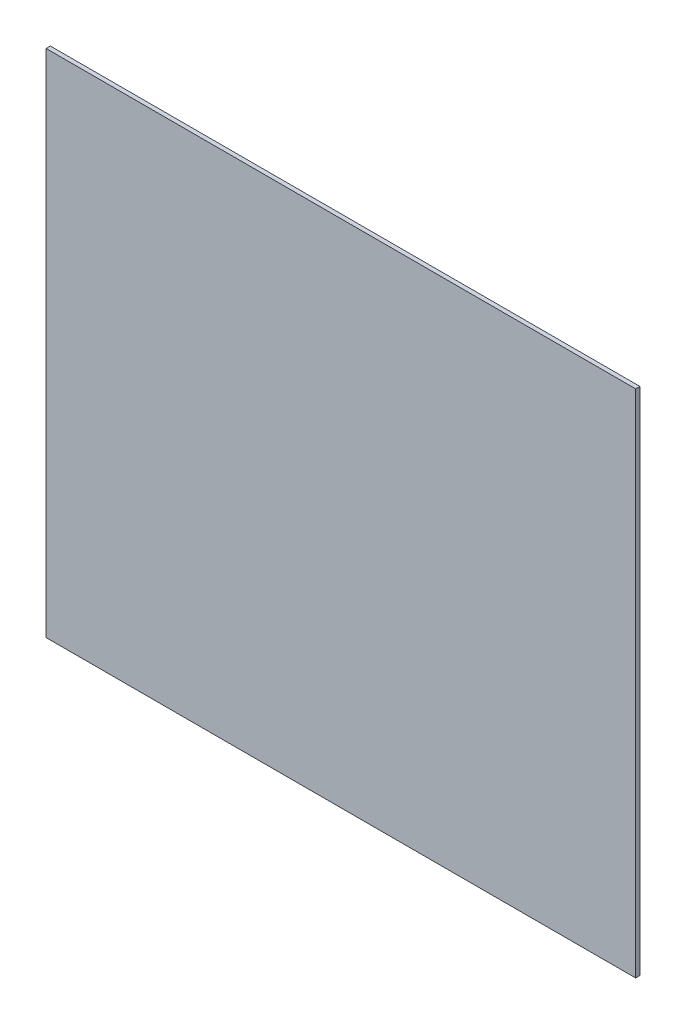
ISO-10303-21;
HEADER;
FILE_DESCRIPTION(('STEP AP214'),'2;1');
FILE_NAME('part.step','',(''),(''),'','','');
FILE_SCHEMA(('AUTOMOTIVE_DESIGN { 1 0 10303 214 1 1 1 1 }'));
ENDSEC;
DATA;
#1=APPLICATION_CONTEXT('core data for automotive mechanical design processes');
#2=APPLICATION_PROTOCOL_DEFINITION('international standard','automotive_design',2000,#1);
#3=PRODUCT_CONTEXT('',#1,'mechanical');
#4=PRODUCT('Part','Part','',(#3));
#5=PRODUCT_RELATED_PRODUCT_CATEGORY('part','',(#4));
#6=PRODUCT_DEFINITION_FORMATION('','',#4);
#7=PRODUCT_DEFINITION_CONTEXT('part definition',#1,'design');
#8=PRODUCT_DEFINITION('design','',#6,#7);
#9=PRODUCT_DEFINITION_SHAPE('','',#8);
#10=(LENGTH_UNIT() NAMED_UNIT(*) SI_UNIT(.MILLI.,.METRE.));
#11=(NAMED_UNIT(*) PLANE_ANGLE_UNIT() SI_UNIT($,.RADIAN.));
#12=(NAMED_UNIT(*) SI_UNIT($,.STERADIAN.) SOLID_ANGLE_UNIT());
#13=UNCERTAINTY_MEASURE_WITH_UNIT(LENGTH_MEASURE(1.E-05),#10,'distance_accuracy_value','');
#14=(GEOMETRIC_REPRESENTATION_CONTEXT(3) GLOBAL_UNCERTAINTY_ASSIGNED_CONTEXT((#13)) GLOBAL_UNIT_ASSIGNED_CONTEXT((#10,
#11,#12)) REPRESENTATION_CONTEXT('',''));
#15=CARTESIAN_POINT('',(0.,0.,0.));
#16=DIRECTION('',(0.,0.,1.));
#17=DIRECTION('',(1.,0.,0.));
#18=AXIS2_PLACEMENT_3D('',#15,#16,#17);
#19=CARTESIAN_POINT('',(330.2,285.75,4.7625));
#20=DIRECTION('',(-1.,0.,0.));
#21=DIRECTION('',(0.,-1.,0.));
#22=AXIS2_PLACEMENT_3D('',#19,#20,#21);
#23=PLANE('',#22);
#24=DIRECTION('',(0.,1.,0.));
#25=VECTOR('',#24,1.);
#26=CARTESIAN_POINT('',(330.2,285.75,0.));
#27=LINE('',#26,#25);
#28=CARTESIAN_POINT('',(330.2,-285.75,0.));
#29=VERTEX_POINT('',#28);
#30=CARTESIAN_POINT('',(330.2,285.75,0.));
#31=VERTEX_POINT('',#30);
#32=EDGE_CURVE('E97',#29,#31,#27,.T.);
#33=ORIENTED_EDGE('',*,*,#32,.T.);
#34=DIRECTION('',(0.,0.,-1.));
#35=VECTOR('',#34,1.);
#36=CARTESIAN_POINT('',(330.2,285.75,4.7625));
#37=LINE('',#36,#35);
#38=CARTESIAN_POINT('',(330.2,285.75,4.7625));
#39=VERTEX_POINT('',#38);
#40=EDGE_CURVE('E11',#39,#31,#37,.T.);
#41=ORIENTED_EDGE('',*,*,#40,.F.);
#42=DIRECTION('',(0.,1.,0.));
#43=VECTOR('',#42,1.);
#44=CARTESIAN_POINT('',(330.2,285.75,4.7625));
#45=LINE('',#44,#43);
#46=CARTESIAN_POINT('',(330.2,-285.75,4.7625));
#47=VERTEX_POINT('',#46);
#48=EDGE_CURVE('E85',#47,#39,#45,.T.);
#49=ORIENTED_EDGE('',*,*,#48,.F.);
#50=DIRECTION('',(0.,0.,-1.));
#51=VECTOR('',#50,1.);
#52=CARTESIAN_POINT('',(330.2,-285.75,4.7625));
#53=LINE('',#52,#51);
#54=EDGE_CURVE('E93',#47,#29,#53,.T.);
#55=ORIENTED_EDGE('',*,*,#54,.T.);
#56=EDGE_LOOP('',(#33,#41,#49,#55));
#57=FACE_BOUND('',#56,.T.);
#58=ADVANCED_FACE('F34',(#57),#23,.F.);
#59=CARTESIAN_POINT('',(-330.2,285.75,4.7625));
#60=DIRECTION('',(0.,-1.,0.));
#61=DIRECTION('',(0.,0.,-1.));
#62=AXIS2_PLACEMENT_3D('',#59,#60,#61);
#63=PLANE('',#62);
#64=DIRECTION('',(-1.,0.,0.));
#65=VECTOR('',#64,1.);
#66=CARTESIAN_POINT('',(-330.2,285.75,0.));
#67=LINE('',#66,#65);
#68=CARTESIAN_POINT('',(-330.2,285.75,0.));
#69=VERTEX_POINT('',#68);
#70=EDGE_CURVE('E89',#31,#69,#67,.T.);
#71=ORIENTED_EDGE('',*,*,#70,.T.);
#72=DIRECTION('',(0.,0.,-1.));
#73=VECTOR('',#72,1.);
#74=CARTESIAN_POINT('',(-330.2,285.75,4.7625));
#75=LINE('',#74,#73);
#76=CARTESIAN_POINT('',(-330.2,285.75,4.7625));
#77=VERTEX_POINT('',#76);
#78=EDGE_CURVE('E42',#77,#69,#75,.T.);
#79=ORIENTED_EDGE('',*,*,#78,.F.);
#80=DIRECTION('',(-1.,0.,0.));
#81=VECTOR('',#80,1.);
#82=CARTESIAN_POINT('',(-330.2,285.75,4.7625));
#83=LINE('',#82,#81);
#84=EDGE_CURVE('E80',#39,#77,#83,.T.);
#85=ORIENTED_EDGE('',*,*,#84,.F.);
#86=ORIENTED_EDGE('',*,*,#40,.T.);
#87=EDGE_LOOP('',(#71,#79,#85,#86));
#88=FACE_BOUND('',#87,.T.);
#89=ADVANCED_FACE('F88',(#88),#63,.F.);
#90=CARTESIAN_POINT('',(-330.2,285.75,4.7625));
#91=DIRECTION('',(1.,0.,0.));
#92=DIRECTION('',(0.,1.,0.));
#93=AXIS2_PLACEMENT_3D('',#90,#91,#92);
#94=PLANE('',#93);
#95=DIRECTION('',(0.,-1.,0.));
#96=VECTOR('',#95,1.);
#97=CARTESIAN_POINT('',(-330.2,285.75,0.));
#98=LINE('',#97,#96);
#99=CARTESIAN_POINT('',(-330.2,-285.75,0.));
#100=VERTEX_POINT('',#99);
#101=EDGE_CURVE('E67',#69,#100,#98,.T.);
#102=ORIENTED_EDGE('',*,*,#101,.T.);
#103=DIRECTION('',(0.,0.,-1.));
#104=VECTOR('',#103,1.);
#105=CARTESIAN_POINT('',(-330.2,-285.75,4.7625));
#106=LINE('',#105,#104);
#107=CARTESIAN_POINT('',(-330.2,-285.75,4.7625));
#108=VERTEX_POINT('',#107);
#109=EDGE_CURVE('E90',#108,#100,#106,.T.);
#110=ORIENTED_EDGE('',*,*,#109,.F.);
#111=DIRECTION('',(0.,-1.,0.));
#112=VECTOR('',#111,1.);
#113=CARTESIAN_POINT('',(-330.2,285.75,4.7625));
#114=LINE('',#113,#112);
#115=EDGE_CURVE('E83',#77,#108,#114,.T.);
#116=ORIENTED_EDGE('',*,*,#115,.F.);
#117=ORIENTED_EDGE('',*,*,#78,.T.);
#118=EDGE_LOOP('',(#102,#110,#116,#117));
#119=FACE_BOUND('',#118,.T.);
#120=ADVANCED_FACE('F91',(#119),#94,.F.);
#121=CARTESIAN_POINT('',(-330.2,-285.75,4.7625));
#122=DIRECTION('',(0.,1.,0.));
#123=DIRECTION('',(0.,0.,1.));
#124=AXIS2_PLACEMENT_3D('',#121,#122,#123);
#125=PLANE('',#124);
#126=DIRECTION('',(1.,0.,0.));
#127=VECTOR('',#126,1.);
#128=CARTESIAN_POINT('',(-330.2,-285.75,0.));
#129=LINE('',#128,#127);
#130=EDGE_CURVE('E73',#100,#29,#129,.T.);
#131=ORIENTED_EDGE('',*,*,#130,.T.);
#132=ORIENTED_EDGE('',*,*,#54,.F.);
#133=DIRECTION('',(1.,0.,0.));
#134=VECTOR('',#133,1.);
#135=CARTESIAN_POINT('',(-330.2,-285.75,4.7625));
#136=LINE('',#135,#134);
#137=EDGE_CURVE('E50',#108,#47,#136,.T.);
#138=ORIENTED_EDGE('',*,*,#137,.F.);
#139=ORIENTED_EDGE('',*,*,#109,.T.);
#140=EDGE_LOOP('',(#131,#132,#138,#139));
#141=FACE_BOUND('',#140,.T.);
#142=ADVANCED_FACE('F104',(#141),#125,.F.);
#143=CARTESIAN_POINT('',(330.2,-285.75,4.7625));
#144=DIRECTION('',(0.,0.,1.));
#145=DIRECTION('',(1.,0.,0.));
#146=AXIS2_PLACEMENT_3D('',#143,#144,#145);
#147=PLANE('',#146);
#148=ORIENTED_EDGE('',*,*,#48,.T.);
#149=ORIENTED_EDGE('',*,*,#84,.T.);
#150=ORIENTED_EDGE('',*,*,#115,.T.);
#151=ORIENTED_EDGE('',*,*,#137,.T.);
#152=EDGE_LOOP('',(#148,#149,#150,#151));
#153=FACE_BOUND('',#152,.T.);
#154=ADVANCED_FACE('F81',(#153),#147,.T.);
#155=CARTESIAN_POINT('',(330.2,-285.75,0.));
#156=DIRECTION('',(0.,0.,1.));
#157=DIRECTION('',(1.,0.,0.));
#158=AXIS2_PLACEMENT_3D('',#155,#156,#157);
#159=PLANE('',#158);
#160=ORIENTED_EDGE('',*,*,#32,.F.);
#161=ORIENTED_EDGE('',*,*,#130,.F.);
#162=ORIENTED_EDGE('',*,*,#101,.F.);
#163=ORIENTED_EDGE('',*,*,#70,.F.);
#164=EDGE_LOOP('',(#160,#161,#162,#163));
#165=FACE_BOUND('',#164,.T.);
#166=ADVANCED_FACE('F107',(#165),#159,.F.);
#167=CLOSED_SHELL('',(#58,#89,#120,#142,#154,#166));
#168=MANIFOLD_SOLID_BREP('B2',#167);
#169=ADVANCED_BREP_SHAPE_REPRESENTATION('',(#18,#168),#14);
#170=SHAPE_DEFINITION_REPRESENTATION(#9,#169);
ENDSEC;
END-ISO-10303-21;
